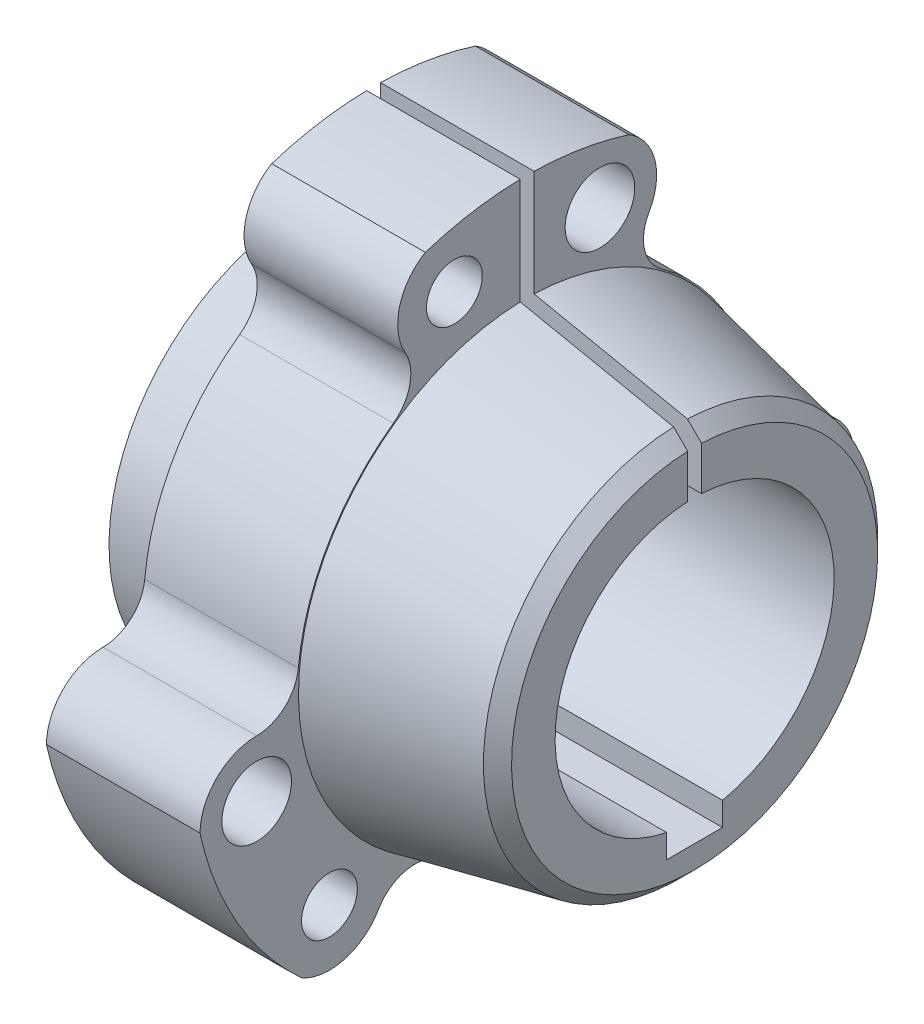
ISO-10303-21;
HEADER;
FILE_DESCRIPTION(('STEP AP214'),'2;1');
FILE_NAME('part.step','',(''),(''),'','','');
FILE_SCHEMA(('AUTOMOTIVE_DESIGN { 1 0 10303 214 1 1 1 1 }'));
ENDSEC;
DATA;
#1=APPLICATION_CONTEXT('core data for automotive mechanical design processes');
#2=APPLICATION_PROTOCOL_DEFINITION('international standard','automotive_design',2000,#1);
#3=PRODUCT_CONTEXT('',#1,'mechanical');
#4=PRODUCT('Part','Part','',(#3));
#5=PRODUCT_RELATED_PRODUCT_CATEGORY('part','',(#4));
#6=PRODUCT_DEFINITION_FORMATION('','',#4);
#7=PRODUCT_DEFINITION_CONTEXT('part definition',#1,'design');
#8=PRODUCT_DEFINITION('design','',#6,#7);
#9=PRODUCT_DEFINITION_SHAPE('','',#8);
#10=(LENGTH_UNIT() NAMED_UNIT(*) SI_UNIT(.MILLI.,.METRE.));
#11=(NAMED_UNIT(*) PLANE_ANGLE_UNIT() SI_UNIT($,.RADIAN.));
#12=(NAMED_UNIT(*) SI_UNIT($,.STERADIAN.) SOLID_ANGLE_UNIT());
#13=UNCERTAINTY_MEASURE_WITH_UNIT(LENGTH_MEASURE(1.E-05),#10,'distance_accuracy_value','');
#14=(GEOMETRIC_REPRESENTATION_CONTEXT(3) GLOBAL_UNCERTAINTY_ASSIGNED_CONTEXT((#13)) GLOBAL_UNIT_ASSIGNED_CONTEXT((#10,
#11,#12)) REPRESENTATION_CONTEXT('',''));
#15=CARTESIAN_POINT('',(0.,0.,0.));
#16=DIRECTION('',(0.,0.,1.));
#17=DIRECTION('',(1.,0.,0.));
#18=AXIS2_PLACEMENT_3D('',#15,#16,#17);
#19=CARTESIAN_POINT('',(0.,0.,0.));
#20=DIRECTION('',(-1.,0.,0.));
#21=DIRECTION('',(0.,0.,1.));
#22=AXIS2_PLACEMENT_3D('',#19,#20,#21);
#23=CYLINDRICAL_SURFACE('',#22,15.875);
#24=CARTESIAN_POINT('',(-7.9248,0.,0.));
#25=DIRECTION('',(-1.,0.,0.));
#26=DIRECTION('',(0.,0.,1.));
#27=AXIS2_PLACEMENT_3D('',#24,#25,#26);
#28=CIRCLE('',#27,15.875);
#29=CARTESIAN_POINT('',(-7.9248,15.8554604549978,-0.7874));
#30=VERTEX_POINT('',#29);
#31=CARTESIAN_POINT('',(-7.9248,-15.5542598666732,-3.175));
#32=VERTEX_POINT('',#31);
#33=EDGE_CURVE('E364',#30,#32,#28,.T.);
#34=ORIENTED_EDGE('',*,*,#33,.T.);
#35=DIRECTION('',(-1.,0.,0.));
#36=VECTOR('',#35,1.);
#37=CARTESIAN_POINT('',(0.,-15.5542598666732,-3.175));
#38=LINE('',#37,#36);
#39=CARTESIAN_POINT('',(36.5252,-15.5542598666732,-3.175));
#40=VERTEX_POINT('',#39);
#41=EDGE_CURVE('E273',#32,#40,#38,.F.);
#42=ORIENTED_EDGE('',*,*,#41,.T.);
#43=CARTESIAN_POINT('',(36.5252,0.,0.));
#44=DIRECTION('',(-1.,0.,0.));
#45=DIRECTION('',(0.,0.,1.));
#46=AXIS2_PLACEMENT_3D('',#43,#44,#45);
#47=CIRCLE('',#46,15.875);
#48=CARTESIAN_POINT('',(36.5252,15.8554604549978,-0.7874));
#49=VERTEX_POINT('',#48);
#50=EDGE_CURVE('E367',#49,#40,#47,.T.);
#51=ORIENTED_EDGE('',*,*,#50,.F.);
#52=DIRECTION('',(-1.,0.,0.));
#53=VECTOR('',#52,1.);
#54=CARTESIAN_POINT('',(0.,15.8554604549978,-0.7874));
#55=LINE('',#54,#53);
#56=EDGE_CURVE('E525',#49,#30,#55,.T.);
#57=ORIENTED_EDGE('',*,*,#56,.T.);
#58=EDGE_LOOP('',(#34,#42,#51,#57));
#59=FACE_BOUND('',#58,.T.);
#60=ADVANCED_FACE('F54',(#59),#23,.F.);
#61=CARTESIAN_POINT('',(0.,0.,0.));
#62=DIRECTION('',(-1.,0.,0.));
#63=DIRECTION('',(0.,0.,1.));
#64=AXIS2_PLACEMENT_3D('',#61,#62,#63);
#65=CYLINDRICAL_SURFACE('',#64,38.1);
#66=DIRECTION('',(-1.,0.,0.));
#67=VECTOR('',#66,1.);
#68=CARTESIAN_POINT('',(0.,38.0918626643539,0.7874));
#69=LINE('',#68,#67);
#70=CARTESIAN_POINT('',(0.,38.0918626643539,0.7874));
#71=VERTEX_POINT('',#70);
#72=CARTESIAN_POINT('',(17.4752,38.0918626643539,0.7874));
#73=VERTEX_POINT('',#72);
#74=EDGE_CURVE('E305',#71,#73,#69,.F.);
#75=ORIENTED_EDGE('',*,*,#74,.F.);
#76=CARTESIAN_POINT('',(0.,0.,0.));
#77=DIRECTION('',(-1.,0.,0.));
#78=DIRECTION('',(0.,0.,1.));
#79=AXIS2_PLACEMENT_3D('',#76,#77,#78);
#80=CIRCLE('',#79,38.1);
#81=CARTESIAN_POINT('',(0.,36.2942672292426,11.5903479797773));
#82=VERTEX_POINT('',#81);
#83=EDGE_CURVE('E559',#82,#71,#80,.T.);
#84=ORIENTED_EDGE('',*,*,#83,.F.);
#85=DIRECTION('',(-1.,0.,0.));
#86=VECTOR('',#85,1.);
#87=CARTESIAN_POINT('',(8.7376,36.2942672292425,11.5903479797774));
#88=LINE('',#87,#86);
#89=CARTESIAN_POINT('',(17.4752,36.2942672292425,11.5903479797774));
#90=VERTEX_POINT('',#89);
#91=EDGE_CURVE('E353',#90,#82,#88,.T.);
#92=ORIENTED_EDGE('',*,*,#91,.F.);
#93=CARTESIAN_POINT('',(17.4752,0.,0.));
#94=DIRECTION('',(-1.,0.,0.));
#95=DIRECTION('',(0.,0.,1.));
#96=AXIS2_PLACEMENT_3D('',#93,#94,#95);
#97=CIRCLE('',#96,38.1);
#98=EDGE_CURVE('E575',#90,#73,#97,.T.);
#99=ORIENTED_EDGE('',*,*,#98,.T.);
#100=EDGE_LOOP('',(#75,#84,#92,#99));
#101=FACE_BOUND('',#100,.T.);
#102=ADVANCED_FACE('F657',(#101),#65,.T.);
#103=CARTESIAN_POINT('',(17.4752,26.0160697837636,0.));
#104=DIRECTION('',(-1.,0.,0.));
#105=DIRECTION('',(0.,0.,1.));
#106=AXIS2_PLACEMENT_3D('',#103,#104,#105);
#107=PLANE('',#106);
#108=CARTESIAN_POINT('',(17.4752,-8.2071897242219,-30.7760695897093));
#109=DIRECTION('',(-1.,0.,0.));
#110=DIRECTION('',(0.,0.,1.));
#111=AXIS2_PLACEMENT_3D('',#108,#109,#110);
#112=CIRCLE('',#111,3.175);
#113=CARTESIAN_POINT('',(17.4752,-8.2071897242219,-27.6010695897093));
#114=VERTEX_POINT('',#113);
#115=EDGE_CURVE('E420',#114,#114,#112,.F.);
#116=ORIENTED_EDGE('',*,*,#115,.F.);
#117=EDGE_LOOP('',(#116));
#118=FACE_BOUND('',#117,.T.);
#119=CARTESIAN_POINT('',(17.4752,30.7564529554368,8.2804));
#120=DIRECTION('',(-1.,0.,0.));
#121=DIRECTION('',(0.,0.,1.));
#122=AXIS2_PLACEMENT_3D('',#119,#120,#121);
#123=CIRCLE('',#122,3.175);
#124=CARTESIAN_POINT('',(17.4752,30.7564529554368,11.4554));
#125=VERTEX_POINT('',#124);
#126=EDGE_CURVE('E408',#125,#125,#123,.F.);
#127=ORIENTED_EDGE('',*,*,#126,.F.);
#128=EDGE_LOOP('',(#127));
#129=FACE_BOUND('',#128,.T.);
#130=CARTESIAN_POINT('',(17.4752,-22.5492632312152,-22.4956695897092));
#131=DIRECTION('',(-1.,0.,0.));
#132=DIRECTION('',(0.,0.,1.));
#133=AXIS2_PLACEMENT_3D('',#130,#131,#132);
#134=CIRCLE('',#133,3.9624);
#135=CARTESIAN_POINT('',(17.4752,-22.5492632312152,-18.5332695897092));
#136=VERTEX_POINT('',#135);
#137=EDGE_CURVE('E396',#136,#136,#134,.F.);
#138=ORIENTED_EDGE('',*,*,#137,.F.);
#139=EDGE_LOOP('',(#138));
#140=FACE_BOUND('',#139,.T.);
#141=CARTESIAN_POINT('',(17.4752,30.7564529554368,-8.2804));
#142=DIRECTION('',(-1.,0.,0.));
#143=DIRECTION('',(0.,0.,1.));
#144=AXIS2_PLACEMENT_3D('',#141,#142,#143);
#145=CIRCLE('',#144,3.96240000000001);
#146=CARTESIAN_POINT('',(17.4752,30.7564529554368,-4.318));
#147=VERTEX_POINT('',#146);
#148=EDGE_CURVE('E390',#147,#147,#145,.F.);
#149=ORIENTED_EDGE('',*,*,#148,.F.);
#150=EDGE_LOOP('',(#149));
#151=FACE_BOUND('',#150,.T.);
#152=CARTESIAN_POINT('',(17.4752,-8.20718972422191,30.7760695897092));
#153=DIRECTION('',(-1.,0.,0.));
#154=DIRECTION('',(0.,0.,1.));
#155=AXIS2_PLACEMENT_3D('',#152,#153,#154);
#156=CIRCLE('',#155,3.9624);
#157=CARTESIAN_POINT('',(17.4752,-8.20718972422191,34.7384695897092));
#158=VERTEX_POINT('',#157);
#159=EDGE_CURVE('E402',#158,#158,#156,.F.);
#160=ORIENTED_EDGE('',*,*,#159,.F.);
#161=EDGE_LOOP('',(#160));
#162=FACE_BOUND('',#161,.T.);
#163=CARTESIAN_POINT('',(17.4752,-22.5492632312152,22.4956695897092));
#164=DIRECTION('',(-1.,0.,0.));
#165=DIRECTION('',(0.,0.,1.));
#166=AXIS2_PLACEMENT_3D('',#163,#164,#165);
#167=CIRCLE('',#166,3.175);
#168=CARTESIAN_POINT('',(17.4752,-22.5492632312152,25.6706695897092));
#169=VERTEX_POINT('',#168);
#170=EDGE_CURVE('E414',#169,#169,#167,.F.);
#171=ORIENTED_EDGE('',*,*,#170,.F.);
#172=EDGE_LOOP('',(#171));
#173=FACE_BOUND('',#172,.T.);
#174=CARTESIAN_POINT('',(17.4752,38.0918626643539,-0.7874));
#175=VERTEX_POINT('',#174);
#176=CARTESIAN_POINT('',(17.4752,36.2942672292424,-11.5903479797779));
#177=VERTEX_POINT('',#176);
#178=EDGE_CURVE('E378',#175,#177,#97,.T.);
#179=ORIENTED_EDGE('',*,*,#178,.F.);
#180=DIRECTION('',(0.,-1.,0.));
#181=VECTOR('',#180,1.);
#182=CARTESIAN_POINT('',(17.4752,26.0160697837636,-0.7874));
#183=LINE('',#182,#181);
#184=CARTESIAN_POINT('',(17.4752,26.0041513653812,-0.7874));
#185=VERTEX_POINT('',#184);
#186=EDGE_CURVE('E534',#175,#185,#183,.T.);
#187=ORIENTED_EDGE('',*,*,#186,.T.);
#188=CARTESIAN_POINT('',(17.4752,0.,0.));
#189=DIRECTION('',(-1.,0.,0.));
#190=DIRECTION('',(0.,0.,1.));
#191=AXIS2_PLACEMENT_3D('',#188,#189,#190);
#192=CIRCLE('',#191,26.0160697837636);
#193=CARTESIAN_POINT('',(17.4752,26.0041513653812,0.7874));
#194=VERTEX_POINT('',#193);
#195=EDGE_CURVE('E371',#185,#194,#192,.T.);
#196=ORIENTED_EDGE('',*,*,#195,.T.);
#197=DIRECTION('',(0.,-1.,0.));
#198=VECTOR('',#197,1.);
#199=CARTESIAN_POINT('',(17.4752,26.0160697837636,0.7874));
#200=LINE('',#199,#198);
#201=EDGE_CURVE('E307',#73,#194,#200,.T.);
#202=ORIENTED_EDGE('',*,*,#201,.F.);
#203=ORIENTED_EDGE('',*,*,#98,.F.);
#204=CARTESIAN_POINT('',(17.4752,30.756452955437,8.28039999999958));
#205=DIRECTION('',(-1.,0.,0.));
#206=DIRECTION('',(0.,0.,1.));
#207=AXIS2_PLACEMENT_3D('',#204,#205,#206);
#208=CIRCLE('',#207,6.4516);
#209=CARTESIAN_POINT('',(17.4752,27.537331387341,13.8714999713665));
#210=VERTEX_POINT('',#209);
#211=EDGE_CURVE('E500',#210,#90,#208,.T.);
#212=ORIENTED_EDGE('',*,*,#211,.F.);
#213=CARTESIAN_POINT('',(17.4752,25.1546744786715,18.0097944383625));
#214=DIRECTION('',(-1.,0.,0.));
#215=DIRECTION('',(0.,0.,1.));
#216=AXIS2_PLACEMENT_3D('',#213,#214,#215);
#217=CIRCLE('',#216,4.7752);
#218=CARTESIAN_POINT('',(17.4752,21.272015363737,15.2299575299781));
#219=VERTEX_POINT('',#218);
#220=EDGE_CURVE('E496',#219,#210,#217,.F.);
#221=ORIENTED_EDGE('',*,*,#220,.F.);
#222=CARTESIAN_POINT('',(17.4752,0.,0.));
#223=DIRECTION('',(-1.,0.,0.));
#224=DIRECTION('',(0.,0.,1.));
#225=AXIS2_PLACEMENT_3D('',#222,#223,#224);
#226=CIRCLE('',#225,26.162);
#227=CARTESIAN_POINT('',(17.4752,2.55352243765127,26.0370844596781));
#228=VERTEX_POINT('',#227);
#229=EDGE_CURVE('E494',#228,#219,#226,.T.);
#230=ORIENTED_EDGE('',*,*,#229,.F.);
#231=CARTESIAN_POINT('',(17.4752,3.01960226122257,30.7894843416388));
#232=DIRECTION('',(-1.,0.,0.));
#233=DIRECTION('',(0.,0.,1.));
#234=AXIS2_PLACEMENT_3D('',#231,#232,#233);
#235=CIRCLE('',#234,4.7752);
#236=CARTESIAN_POINT('',(17.4752,-1.75559432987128,30.7837785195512));
#237=VERTEX_POINT('',#236);
#238=EDGE_CURVE('E492',#237,#228,#235,.F.);
#239=ORIENTED_EDGE('',*,*,#238,.F.);
#240=CARTESIAN_POINT('',(17.4752,-8.20718972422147,30.7760695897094));
#241=DIRECTION('',(-1.,0.,0.));
#242=DIRECTION('',(0.,0.,1.));
#243=AXIS2_PLACEMENT_3D('',#240,#241,#242);
#244=CIRCLE('',#243,6.45160000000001);
#245=CARTESIAN_POINT('',(17.4752,-8.10959782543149,37.226931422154));
#246=VERTEX_POINT('',#245);
#247=EDGE_CURVE('E498',#246,#237,#244,.T.);
#248=ORIENTED_EDGE('',*,*,#247,.F.);
#249=CARTESIAN_POINT('',(17.4752,-28.1846694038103,25.6365834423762));
#250=VERTEX_POINT('',#249);
#251=EDGE_CURVE('E377',#250,#246,#97,.T.);
#252=ORIENTED_EDGE('',*,*,#251,.F.);
#253=CARTESIAN_POINT('',(17.4752,-22.5492632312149,22.4956695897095));
#254=DIRECTION('',(-1.,0.,0.));
#255=DIRECTION('',(0.,0.,1.));
#256=AXIS2_PLACEMENT_3D('',#253,#254,#255);
#257=CIRCLE('',#256,6.4516);
#258=CARTESIAN_POINT('',(17.4752,-25.7817370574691,16.9122785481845));
#259=VERTEX_POINT('',#258);
#260=EDGE_CURVE('E467',#259,#250,#257,.T.);
#261=ORIENTED_EDGE('',*,*,#260,.F.);
#262=CARTESIAN_POINT('',(17.4752,-28.1742767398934,12.7796899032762));
#263=DIRECTION('',(-1.,0.,0.));
#264=DIRECTION('',(0.,0.,1.));
#265=AXIS2_PLACEMENT_3D('',#262,#263,#264);
#266=CIRCLE('',#265,4.7752);
#267=CARTESIAN_POINT('',(17.4752,-23.8255378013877,10.8071269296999));
#268=VERTEX_POINT('',#267);
#269=EDGE_CURVE('E463',#268,#259,#266,.F.);
#270=ORIENTED_EDGE('',*,*,#269,.F.);
#271=CARTESIAN_POINT('',(17.4752,0.,0.));
#272=DIRECTION('',(-1.,0.,0.));
#273=DIRECTION('',(0.,0.,1.));
#274=AXIS2_PLACEMENT_3D('',#271,#272,#273);
#275=CIRCLE('',#274,26.162);
#276=CARTESIAN_POINT('',(17.4752,-23.8255378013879,-10.8071269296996));
#277=VERTEX_POINT('',#276);
#278=EDGE_CURVE('E461',#277,#268,#275,.T.);
#279=ORIENTED_EDGE('',*,*,#278,.F.);
#280=CARTESIAN_POINT('',(17.4752,-28.1742767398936,-12.7796899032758));
#281=DIRECTION('',(-1.,0.,0.));
#282=DIRECTION('',(0.,0.,1.));
#283=AXIS2_PLACEMENT_3D('',#280,#281,#282);
#284=CIRCLE('',#283,4.7752);
#285=CARTESIAN_POINT('',(17.4752,-25.7817370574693,-16.9122785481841));
#286=VERTEX_POINT('',#285);
#287=EDGE_CURVE('E459',#286,#277,#284,.F.);
#288=ORIENTED_EDGE('',*,*,#287,.F.);
#289=CARTESIAN_POINT('',(17.4752,-22.5492632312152,-22.4956695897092));
#290=DIRECTION('',(-1.,0.,0.));
#291=DIRECTION('',(0.,0.,1.));
#292=AXIS2_PLACEMENT_3D('',#289,#290,#291);
#293=CIRCLE('',#292,6.45160000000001);
#294=CARTESIAN_POINT('',(17.4752,-28.1846694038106,-25.6365834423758));
#295=VERTEX_POINT('',#294);
#296=EDGE_CURVE('E465',#295,#286,#293,.T.);
#297=ORIENTED_EDGE('',*,*,#296,.F.);
#298=CARTESIAN_POINT('',(17.4752,-8.10959782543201,-37.2269314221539));
#299=VERTEX_POINT('',#298);
#300=EDGE_CURVE('E374',#299,#295,#97,.T.);
#301=ORIENTED_EDGE('',*,*,#300,.F.);
#302=CARTESIAN_POINT('',(17.4752,-8.2071897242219,-30.7760695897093));
#303=DIRECTION('',(-1.,0.,0.));
#304=DIRECTION('',(0.,0.,1.));
#305=AXIS2_PLACEMENT_3D('',#302,#303,#304);
#306=CIRCLE('',#305,6.4516);
#307=CARTESIAN_POINT('',(17.4752,-1.7555943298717,-30.7837785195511));
#308=VERTEX_POINT('',#307);
#309=EDGE_CURVE('E434',#308,#299,#306,.T.);
#310=ORIENTED_EDGE('',*,*,#309,.F.);
#311=CARTESIAN_POINT('',(17.4752,3.01960226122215,-30.7894843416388));
#312=DIRECTION('',(-1.,0.,0.));
#313=DIRECTION('',(0.,0.,1.));
#314=AXIS2_PLACEMENT_3D('',#311,#312,#313);
#315=CIRCLE('',#314,4.7752);
#316=CARTESIAN_POINT('',(17.4752,2.55352243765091,-26.0370844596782));
#317=VERTEX_POINT('',#316);
#318=EDGE_CURVE('E430',#317,#308,#315,.F.);
#319=ORIENTED_EDGE('',*,*,#318,.F.);
#320=CARTESIAN_POINT('',(17.4752,0.,0.));
#321=DIRECTION('',(-1.,0.,0.));
#322=DIRECTION('',(0.,0.,1.));
#323=AXIS2_PLACEMENT_3D('',#320,#321,#322);
#324=CIRCLE('',#323,26.162);
#325=CARTESIAN_POINT('',(17.4752,21.2720153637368,-15.2299575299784));
#326=VERTEX_POINT('',#325);
#327=EDGE_CURVE('E428',#326,#317,#324,.T.);
#328=ORIENTED_EDGE('',*,*,#327,.F.);
#329=CARTESIAN_POINT('',(17.4752,25.1546744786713,-18.0097944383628));
#330=DIRECTION('',(-1.,0.,0.));
#331=DIRECTION('',(0.,0.,1.));
#332=AXIS2_PLACEMENT_3D('',#329,#330,#331);
#333=CIRCLE('',#332,4.7752);
#334=CARTESIAN_POINT('',(17.4752,27.5373313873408,-13.8714999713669));
#335=VERTEX_POINT('',#334);
#336=EDGE_CURVE('E426',#335,#326,#333,.F.);
#337=ORIENTED_EDGE('',*,*,#336,.F.);
#338=CARTESIAN_POINT('',(17.4752,30.7564529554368,-8.2804));
#339=DIRECTION('',(-1.,0.,0.));
#340=DIRECTION('',(0.,0.,1.));
#341=AXIS2_PLACEMENT_3D('',#338,#339,#340);
#342=CIRCLE('',#341,6.45160000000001);
#343=EDGE_CURVE('E432',#177,#335,#342,.T.);
#344=ORIENTED_EDGE('',*,*,#343,.F.);
#345=EDGE_LOOP('',(#179,#187,#196,#202,#203,#212,#221,#230,#239,#248,#252,#261,#270,#279,#288,
#297,#301,#310,#319,#328,#337,#344));
#346=FACE_BOUND('',#345,.T.);
#347=ADVANCED_FACE('F587',(#118,#129,#140,#151,#162,#173,#346),#107,.F.);
#348=CARTESIAN_POINT('',(0.,38.1,0.));
#349=DIRECTION('',(1.,0.,0.));
#350=DIRECTION('',(0.,0.,-1.));
#351=AXIS2_PLACEMENT_3D('',#348,#349,#350);
#352=PLANE('',#351);
#353=CARTESIAN_POINT('',(0.,-8.2071897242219,-30.7760695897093));
#354=DIRECTION('',(1.,0.,0.));
#355=DIRECTION('',(0.,0.,-1.));
#356=AXIS2_PLACEMENT_3D('',#353,#354,#355);
#357=CIRCLE('',#356,3.175);
#358=CARTESIAN_POINT('',(0.,-8.2071897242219,-33.9510695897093));
#359=VERTEX_POINT('',#358);
#360=EDGE_CURVE('E423',#359,#359,#357,.T.);
#361=ORIENTED_EDGE('',*,*,#360,.T.);
#362=EDGE_LOOP('',(#361));
#363=FACE_BOUND('',#362,.T.);
#364=CARTESIAN_POINT('',(0.,30.7564529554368,8.2804));
#365=DIRECTION('',(1.,0.,0.));
#366=DIRECTION('',(0.,0.,-1.));
#367=AXIS2_PLACEMENT_3D('',#364,#365,#366);
#368=CIRCLE('',#367,3.175);
#369=CARTESIAN_POINT('',(0.,30.7564529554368,5.1054));
#370=VERTEX_POINT('',#369);
#371=EDGE_CURVE('E411',#370,#370,#368,.T.);
#372=ORIENTED_EDGE('',*,*,#371,.T.);
#373=EDGE_LOOP('',(#372));
#374=FACE_BOUND('',#373,.T.);
#375=CARTESIAN_POINT('',(0.,-22.5492632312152,-22.4956695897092));
#376=DIRECTION('',(1.,0.,0.));
#377=DIRECTION('',(0.,0.,-1.));
#378=AXIS2_PLACEMENT_3D('',#375,#376,#377);
#379=CIRCLE('',#378,3.9624);
#380=CARTESIAN_POINT('',(0.,-22.5492632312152,-26.4580695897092));
#381=VERTEX_POINT('',#380);
#382=EDGE_CURVE('E399',#381,#381,#379,.T.);
#383=ORIENTED_EDGE('',*,*,#382,.T.);
#384=EDGE_LOOP('',(#383));
#385=FACE_BOUND('',#384,.T.);
#386=CARTESIAN_POINT('',(0.,0.,0.));
#387=DIRECTION('',(-1.,0.,0.));
#388=DIRECTION('',(0.,0.,1.));
#389=AXIS2_PLACEMENT_3D('',#386,#387,#388);
#390=CIRCLE('',#389,22.1742);
#391=CARTESIAN_POINT('',(0.,22.1602154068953,-0.7874));
#392=VERTEX_POINT('',#391);
#393=CARTESIAN_POINT('',(0.,22.1602154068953,0.7874));
#394=VERTEX_POINT('',#393);
#395=EDGE_CURVE('E384',#392,#394,#390,.T.);
#396=ORIENTED_EDGE('',*,*,#395,.F.);
#397=DIRECTION('',(0.,1.,0.));
#398=VECTOR('',#397,1.);
#399=CARTESIAN_POINT('',(0.,38.1,-0.7874));
#400=LINE('',#399,#398);
#401=CARTESIAN_POINT('',(0.,38.0918626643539,-0.7874));
#402=VERTEX_POINT('',#401);
#403=EDGE_CURVE('E539',#392,#402,#400,.T.);
#404=ORIENTED_EDGE('',*,*,#403,.T.);
#405=CARTESIAN_POINT('',(0.,36.2942672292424,-11.5903479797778));
#406=VERTEX_POINT('',#405);
#407=EDGE_CURVE('E383',#402,#406,#80,.T.);
#408=ORIENTED_EDGE('',*,*,#407,.T.);
#409=CARTESIAN_POINT('',(0.,30.7564529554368,-8.2804));
#410=DIRECTION('',(-1.,0.,0.));
#411=DIRECTION('',(0.,0.,-1.));
#412=AXIS2_PLACEMENT_3D('',#409,#410,#411);
#413=CIRCLE('',#412,6.45160000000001);
#414=CARTESIAN_POINT('',(0.,27.5373313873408,-13.8714999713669));
#415=VERTEX_POINT('',#414);
#416=EDGE_CURVE('E456',#406,#415,#413,.T.);
#417=ORIENTED_EDGE('',*,*,#416,.T.);
#418=CARTESIAN_POINT('',(0.,25.1546744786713,-18.0097944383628));
#419=DIRECTION('',(1.,0.,0.));
#420=DIRECTION('',(0.,0.,1.));
#421=AXIS2_PLACEMENT_3D('',#418,#419,#420);
#422=CIRCLE('',#421,4.7752);
#423=CARTESIAN_POINT('',(0.,21.2720153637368,-15.2299575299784));
#424=VERTEX_POINT('',#423);
#425=EDGE_CURVE('E453',#415,#424,#422,.T.);
#426=ORIENTED_EDGE('',*,*,#425,.T.);
#427=CARTESIAN_POINT('',(0.,0.,0.));
#428=DIRECTION('',(-1.,0.,0.));
#429=DIRECTION('',(0.,0.,1.));
#430=AXIS2_PLACEMENT_3D('',#427,#428,#429);
#431=CIRCLE('',#430,26.162);
#432=CARTESIAN_POINT('',(0.,2.55352243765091,-26.0370844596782));
#433=VERTEX_POINT('',#432);
#434=EDGE_CURVE('E450',#424,#433,#431,.T.);
#435=ORIENTED_EDGE('',*,*,#434,.T.);
#436=CARTESIAN_POINT('',(0.,3.01960226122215,-30.7894843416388));
#437=DIRECTION('',(1.,0.,0.));
#438=DIRECTION('',(0.,0.,-1.));
#439=AXIS2_PLACEMENT_3D('',#436,#437,#438);
#440=CIRCLE('',#439,4.7752);
#441=CARTESIAN_POINT('',(0.,-1.7555943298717,-30.7837785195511));
#442=VERTEX_POINT('',#441);
#443=EDGE_CURVE('E447',#433,#442,#440,.T.);
#444=ORIENTED_EDGE('',*,*,#443,.T.);
#445=CARTESIAN_POINT('',(0.,-8.2071897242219,-30.7760695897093));
#446=DIRECTION('',(-1.,0.,0.));
#447=DIRECTION('',(0.,0.,-1.));
#448=AXIS2_PLACEMENT_3D('',#445,#446,#447);
#449=CIRCLE('',#448,6.4516);
#450=CARTESIAN_POINT('',(0.,-8.10959782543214,-37.2269314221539));
#451=VERTEX_POINT('',#450);
#452=EDGE_CURVE('E444',#442,#451,#449,.T.);
#453=ORIENTED_EDGE('',*,*,#452,.T.);
#454=CARTESIAN_POINT('',(0.,-28.1846694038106,-25.6365834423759));
#455=VERTEX_POINT('',#454);
#456=EDGE_CURVE('E379',#451,#455,#80,.T.);
#457=ORIENTED_EDGE('',*,*,#456,.T.);
#458=CARTESIAN_POINT('',(0.,-22.5492632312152,-22.4956695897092));
#459=DIRECTION('',(-1.,0.,0.));
#460=DIRECTION('',(0.,-0.866025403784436,0.500000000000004));
#461=AXIS2_PLACEMENT_3D('',#458,#459,#460);
#462=CIRCLE('',#461,6.45160000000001);
#463=CARTESIAN_POINT('',(0.,-25.7817370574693,-16.9122785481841));
#464=VERTEX_POINT('',#463);
#465=EDGE_CURVE('E489',#455,#464,#462,.T.);
#466=ORIENTED_EDGE('',*,*,#465,.T.);
#467=CARTESIAN_POINT('',(0.,-28.1742767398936,-12.7796899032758));
#468=DIRECTION('',(1.,0.,0.));
#469=DIRECTION('',(0.,0.866025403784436,-0.500000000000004));
#470=AXIS2_PLACEMENT_3D('',#467,#468,#469);
#471=CIRCLE('',#470,4.7752);
#472=CARTESIAN_POINT('',(0.,-23.8255378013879,-10.8071269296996));
#473=VERTEX_POINT('',#472);
#474=EDGE_CURVE('E486',#464,#473,#471,.T.);
#475=ORIENTED_EDGE('',*,*,#474,.T.);
#476=CARTESIAN_POINT('',(0.,0.,0.));
#477=DIRECTION('',(-1.,0.,0.));
#478=DIRECTION('',(0.,0.866025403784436,-0.500000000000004));
#479=AXIS2_PLACEMENT_3D('',#476,#477,#478);
#480=CIRCLE('',#479,26.162);
#481=CARTESIAN_POINT('',(0.,-23.8255378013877,10.8071269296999));
#482=VERTEX_POINT('',#481);
#483=EDGE_CURVE('E483',#473,#482,#480,.T.);
#484=ORIENTED_EDGE('',*,*,#483,.T.);
#485=CARTESIAN_POINT('',(0.,-28.1742767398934,12.7796899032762));
#486=DIRECTION('',(1.,0.,0.));
#487=DIRECTION('',(0.,-0.866025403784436,0.500000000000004));
#488=AXIS2_PLACEMENT_3D('',#485,#486,#487);
#489=CIRCLE('',#488,4.7752);
#490=CARTESIAN_POINT('',(0.,-25.7817370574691,16.9122785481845));
#491=VERTEX_POINT('',#490);
#492=EDGE_CURVE('E480',#482,#491,#489,.T.);
#493=ORIENTED_EDGE('',*,*,#492,.T.);
#494=CARTESIAN_POINT('',(0.,-22.5492632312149,22.4956695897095));
#495=DIRECTION('',(-1.,0.,0.));
#496=DIRECTION('',(0.,-0.866025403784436,0.500000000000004));
#497=AXIS2_PLACEMENT_3D('',#494,#495,#496);
#498=CIRCLE('',#497,6.4516);
#499=CARTESIAN_POINT('',(0.,-28.1846694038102,25.6365834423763));
#500=VERTEX_POINT('',#499);
#501=EDGE_CURVE('E477',#491,#500,#498,.T.);
#502=ORIENTED_EDGE('',*,*,#501,.T.);
#503=CARTESIAN_POINT('',(0.,-8.10959782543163,37.226931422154));
#504=VERTEX_POINT('',#503);
#505=EDGE_CURVE('E382',#500,#504,#80,.T.);
#506=ORIENTED_EDGE('',*,*,#505,.T.);
#507=CARTESIAN_POINT('',(0.,-8.20718972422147,30.7760695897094));
#508=DIRECTION('',(-1.,0.,0.));
#509=DIRECTION('',(0.,0.866025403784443,0.499999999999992));
#510=AXIS2_PLACEMENT_3D('',#507,#508,#509);
#511=CIRCLE('',#510,6.45160000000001);
#512=CARTESIAN_POINT('',(0.,-1.75559432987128,30.7837785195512));
#513=VERTEX_POINT('',#512);
#514=EDGE_CURVE('E522',#504,#513,#511,.T.);
#515=ORIENTED_EDGE('',*,*,#514,.T.);
#516=CARTESIAN_POINT('',(0.,3.01960226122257,30.7894843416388));
#517=DIRECTION('',(1.,0.,0.));
#518=DIRECTION('',(0.,-0.866025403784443,-0.499999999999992));
#519=AXIS2_PLACEMENT_3D('',#516,#517,#518);
#520=CIRCLE('',#519,4.7752);
#521=CARTESIAN_POINT('',(0.,2.55352243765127,26.0370844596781));
#522=VERTEX_POINT('',#521);
#523=EDGE_CURVE('E519',#513,#522,#520,.T.);
#524=ORIENTED_EDGE('',*,*,#523,.T.);
#525=CARTESIAN_POINT('',(0.,0.,0.));
#526=DIRECTION('',(-1.,0.,0.));
#527=DIRECTION('',(0.,-0.866025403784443,-0.499999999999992));
#528=AXIS2_PLACEMENT_3D('',#525,#526,#527);
#529=CIRCLE('',#528,26.162);
#530=CARTESIAN_POINT('',(0.,21.272015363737,15.2299575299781));
#531=VERTEX_POINT('',#530);
#532=EDGE_CURVE('E516',#522,#531,#529,.T.);
#533=ORIENTED_EDGE('',*,*,#532,.T.);
#534=CARTESIAN_POINT('',(0.,25.1546744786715,18.0097944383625));
#535=DIRECTION('',(1.,0.,0.));
#536=DIRECTION('',(0.,0.866025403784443,0.499999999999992));
#537=AXIS2_PLACEMENT_3D('',#534,#535,#536);
#538=CIRCLE('',#537,4.7752);
#539=CARTESIAN_POINT('',(0.,27.537331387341,13.8714999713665));
#540=VERTEX_POINT('',#539);
#541=EDGE_CURVE('E513',#531,#540,#538,.T.);
#542=ORIENTED_EDGE('',*,*,#541,.T.);
#543=CARTESIAN_POINT('',(0.,30.756452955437,8.28039999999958));
#544=DIRECTION('',(-1.,0.,0.));
#545=DIRECTION('',(0.,0.866025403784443,0.499999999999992));
#546=AXIS2_PLACEMENT_3D('',#543,#544,#545);
#547=CIRCLE('',#546,6.4516);
#548=EDGE_CURVE('E510',#540,#82,#547,.T.);
#549=ORIENTED_EDGE('',*,*,#548,.T.);
#550=ORIENTED_EDGE('',*,*,#83,.T.);
#551=DIRECTION('',(0.,1.,0.));
#552=VECTOR('',#551,1.);
#553=CARTESIAN_POINT('',(0.,38.1,0.7874));
#554=LINE('',#553,#552);
#555=EDGE_CURVE('E303',#394,#71,#554,.T.);
#556=ORIENTED_EDGE('',*,*,#555,.F.);
#557=EDGE_LOOP('',(#396,#404,#408,#417,#426,#435,#444,#453,#457,#466,#475,#484,#493,#502,#506,
#515,#524,#533,#542,#549,#550,#556));
#558=FACE_BOUND('',#557,.T.);
#559=CARTESIAN_POINT('',(0.,30.7564529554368,-8.2804));
#560=DIRECTION('',(1.,0.,0.));
#561=DIRECTION('',(0.,0.,-1.));
#562=AXIS2_PLACEMENT_3D('',#559,#560,#561);
#563=CIRCLE('',#562,3.96240000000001);
#564=CARTESIAN_POINT('',(0.,30.7564529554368,-12.2428));
#565=VERTEX_POINT('',#564);
#566=EDGE_CURVE('E393',#565,#565,#563,.T.);
#567=ORIENTED_EDGE('',*,*,#566,.T.);
#568=EDGE_LOOP('',(#567));
#569=FACE_BOUND('',#568,.T.);
#570=CARTESIAN_POINT('',(0.,-8.20718972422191,30.7760695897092));
#571=DIRECTION('',(1.,0.,0.));
#572=DIRECTION('',(0.,0.,-1.));
#573=AXIS2_PLACEMENT_3D('',#570,#571,#572);
#574=CIRCLE('',#573,3.9624);
#575=CARTESIAN_POINT('',(0.,-8.20718972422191,26.8136695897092));
#576=VERTEX_POINT('',#575);
#577=EDGE_CURVE('E405',#576,#576,#574,.T.);
#578=ORIENTED_EDGE('',*,*,#577,.T.);
#579=EDGE_LOOP('',(#578));
#580=FACE_BOUND('',#579,.T.);
#581=CARTESIAN_POINT('',(0.,-22.5492632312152,22.4956695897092));
#582=DIRECTION('',(1.,0.,0.));
#583=DIRECTION('',(0.,0.,-1.));
#584=AXIS2_PLACEMENT_3D('',#581,#582,#583);
#585=CIRCLE('',#584,3.175);
#586=CARTESIAN_POINT('',(0.,-22.5492632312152,19.3206695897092));
#587=VERTEX_POINT('',#586);
#588=EDGE_CURVE('E417',#587,#587,#585,.T.);
#589=ORIENTED_EDGE('',*,*,#588,.T.);
#590=EDGE_LOOP('',(#589));
#591=FACE_BOUND('',#590,.T.);
#592=ADVANCED_FACE('F556',(#363,#374,#385,#558,#569,#580,#591),#352,.F.);
#593=DIRECTION('',(-1.,0.,0.));
#594=VECTOR('',#593,1.);
#595=CARTESIAN_POINT('',(8.7376,-8.10959782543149,37.226931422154));
#596=LINE('',#595,#594);
#597=EDGE_CURVE('E351',#504,#246,#596,.F.);
#598=ORIENTED_EDGE('',*,*,#597,.F.);
#599=ORIENTED_EDGE('',*,*,#505,.F.);
#600=DIRECTION('',(-1.,0.,0.));
#601=VECTOR('',#600,1.);
#602=CARTESIAN_POINT('',(8.7376,-28.1846694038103,25.6365834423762));
#603=LINE('',#602,#601);
#604=EDGE_CURVE('E357',#250,#500,#603,.T.);
#605=ORIENTED_EDGE('',*,*,#604,.F.);
#606=ORIENTED_EDGE('',*,*,#251,.T.);
#607=EDGE_LOOP('',(#598,#599,#605,#606));
#608=FACE_BOUND('',#607,.T.);
#609=ADVANCED_FACE('F583',(#608),#65,.T.);
#610=ORIENTED_EDGE('',*,*,#407,.F.);
#611=DIRECTION('',(-1.,0.,0.));
#612=VECTOR('',#611,1.);
#613=CARTESIAN_POINT('',(0.,38.0918626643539,-0.7874));
#614=LINE('',#613,#612);
#615=EDGE_CURVE('E537',#402,#175,#614,.F.);
#616=ORIENTED_EDGE('',*,*,#615,.T.);
#617=ORIENTED_EDGE('',*,*,#178,.T.);
#618=DIRECTION('',(-1.,0.,0.));
#619=VECTOR('',#618,1.);
#620=CARTESIAN_POINT('',(25.4,36.2942672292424,-11.5903479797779));
#621=LINE('',#620,#619);
#622=EDGE_CURVE('E359',#406,#177,#621,.F.);
#623=ORIENTED_EDGE('',*,*,#622,.F.);
#624=EDGE_LOOP('',(#610,#616,#617,#623));
#625=FACE_BOUND('',#624,.T.);
#626=ADVANCED_FACE('F572',(#625),#65,.T.);
#627=DIRECTION('',(-1.,0.,0.));
#628=VECTOR('',#627,1.);
#629=CARTESIAN_POINT('',(8.7376,-28.1846694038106,-25.6365834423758));
#630=LINE('',#629,#628);
#631=EDGE_CURVE('E355',#455,#295,#630,.F.);
#632=ORIENTED_EDGE('',*,*,#631,.F.);
#633=ORIENTED_EDGE('',*,*,#456,.F.);
#634=DIRECTION('',(-1.,0.,0.));
#635=VECTOR('',#634,1.);
#636=CARTESIAN_POINT('',(25.4,-8.10959782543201,-37.2269314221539));
#637=LINE('',#636,#635);
#638=EDGE_CURVE('E362',#299,#451,#637,.T.);
#639=ORIENTED_EDGE('',*,*,#638,.F.);
#640=ORIENTED_EDGE('',*,*,#300,.T.);
#641=EDGE_LOOP('',(#632,#633,#639,#640));
#642=FACE_BOUND('',#641,.T.);
#643=ADVANCED_FACE('F625',(#642),#65,.T.);
#644=CARTESIAN_POINT('',(-7.9248,22.1742,0.));
#645=DIRECTION('',(1.,0.,0.));
#646=DIRECTION('',(0.,0.,-1.));
#647=AXIS2_PLACEMENT_3D('',#644,#645,#646);
#648=PLANE('',#647);
#649=DIRECTION('',(0.,0.,-1.));
#650=VECTOR('',#649,1.);
#651=CARTESIAN_POINT('',(-7.9248,-18.2372,0.));
#652=LINE('',#651,#650);
#653=CARTESIAN_POINT('',(-7.9248,-18.2372,3.175));
#654=VERTEX_POINT('',#653);
#655=CARTESIAN_POINT('',(-7.9248,-18.2372,-3.175));
#656=VERTEX_POINT('',#655);
#657=EDGE_CURVE('E263',#654,#656,#652,.T.);
#658=ORIENTED_EDGE('',*,*,#657,.T.);
#659=DIRECTION('',(0.,1.,0.));
#660=VECTOR('',#659,1.);
#661=CARTESIAN_POINT('',(-7.9248,22.1742,-3.175));
#662=LINE('',#661,#660);
#663=EDGE_CURVE('E292',#656,#32,#662,.T.);
#664=ORIENTED_EDGE('',*,*,#663,.T.);
#665=ORIENTED_EDGE('',*,*,#33,.F.);
#666=DIRECTION('',(0.,1.,0.));
#667=VECTOR('',#666,1.);
#668=CARTESIAN_POINT('',(-7.9248,0.,-0.7874));
#669=LINE('',#668,#667);
#670=CARTESIAN_POINT('',(-7.9248,22.1602154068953,-0.7874));
#671=VERTEX_POINT('',#670);
#672=EDGE_CURVE('E298',#30,#671,#669,.T.);
#673=ORIENTED_EDGE('',*,*,#672,.T.);
#674=CARTESIAN_POINT('',(-7.9248,0.,0.));
#675=DIRECTION('',(-1.,0.,0.));
#676=DIRECTION('',(0.,0.,1.));
#677=AXIS2_PLACEMENT_3D('',#674,#675,#676);
#678=CIRCLE('',#677,22.1742);
#679=CARTESIAN_POINT('',(-7.9248,22.1602154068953,0.7874));
#680=VERTEX_POINT('',#679);
#681=EDGE_CURVE('E387',#671,#680,#678,.T.);
#682=ORIENTED_EDGE('',*,*,#681,.T.);
#683=DIRECTION('',(0.,1.,0.));
#684=VECTOR('',#683,1.);
#685=CARTESIAN_POINT('',(-7.9248,0.,0.7874));
#686=LINE('',#685,#684);
#687=CARTESIAN_POINT('',(-7.9248,15.8554604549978,0.7874));
#688=VERTEX_POINT('',#687);
#689=EDGE_CURVE('E301',#688,#680,#686,.T.);
#690=ORIENTED_EDGE('',*,*,#689,.F.);
#691=CARTESIAN_POINT('',(-7.9248,-15.5542598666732,3.175));
#692=VERTEX_POINT('',#691);
#693=EDGE_CURVE('E285',#692,#688,#28,.T.);
#694=ORIENTED_EDGE('',*,*,#693,.F.);
#695=DIRECTION('',(0.,-1.,0.));
#696=VECTOR('',#695,1.);
#697=CARTESIAN_POINT('',(-7.9248,22.1742,3.175));
#698=LINE('',#697,#696);
#699=EDGE_CURVE('E274',#692,#654,#698,.T.);
#700=ORIENTED_EDGE('',*,*,#699,.T.);
#701=EDGE_LOOP('',(#658,#664,#665,#673,#682,#690,#694,#700));
#702=FACE_BOUND('',#701,.T.);
#703=ADVANCED_FACE('F283',(#702),#648,.F.);
#704=CARTESIAN_POINT('',(36.5252,-15.5542598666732,3.175));
#705=VERTEX_POINT('',#704);
#706=CARTESIAN_POINT('',(36.5252,15.8554604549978,0.7874));
#707=VERTEX_POINT('',#706);
#708=EDGE_CURVE('E370',#705,#707,#47,.T.);
#709=ORIENTED_EDGE('',*,*,#708,.F.);
#710=DIRECTION('',(-1.,0.,0.));
#711=VECTOR('',#710,1.);
#712=CARTESIAN_POINT('',(0.,-15.5542598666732,3.175));
#713=LINE('',#712,#711);
#714=EDGE_CURVE('E286',#705,#692,#713,.T.);
#715=ORIENTED_EDGE('',*,*,#714,.T.);
#716=ORIENTED_EDGE('',*,*,#693,.T.);
#717=DIRECTION('',(-1.,0.,0.));
#718=VECTOR('',#717,1.);
#719=CARTESIAN_POINT('',(0.,15.8554604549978,0.7874));
#720=LINE('',#719,#718);
#721=EDGE_CURVE('E316',#707,#688,#720,.T.);
#722=ORIENTED_EDGE('',*,*,#721,.F.);
#723=EDGE_LOOP('',(#709,#715,#716,#722));
#724=FACE_BOUND('',#723,.T.);
#725=ADVANCED_FACE('F660',(#724),#23,.F.);
#726=CARTESIAN_POINT('',(36.5252,15.875,0.));
#727=DIRECTION('',(-1.,0.,0.));
#728=DIRECTION('',(0.,0.,1.));
#729=AXIS2_PLACEMENT_3D('',#726,#727,#728);
#730=PLANE('',#729);
#731=DIRECTION('',(0.,1.,0.));
#732=VECTOR('',#731,1.);
#733=CARTESIAN_POINT('',(36.5252,0.,0.7874));
#734=LINE('',#733,#732);
#735=CARTESIAN_POINT('',(36.5252,20.813110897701,0.7874));
#736=VERTEX_POINT('',#735);
#737=EDGE_CURVE('E296',#707,#736,#734,.T.);
#738=ORIENTED_EDGE('',*,*,#737,.T.);
#739=CARTESIAN_POINT('',(36.5252,0.,0.));
#740=DIRECTION('',(-1.,0.,0.));
#741=DIRECTION('',(0.,0.,1.));
#742=AXIS2_PLACEMENT_3D('',#739,#740,#741);
#743=CIRCLE('',#742,20.828);
#744=CARTESIAN_POINT('',(36.5252,20.813110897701,-0.7874));
#745=VERTEX_POINT('',#744);
#746=EDGE_CURVE('E67',#736,#745,#743,.F.);
#747=ORIENTED_EDGE('',*,*,#746,.T.);
#748=DIRECTION('',(0.,1.,0.));
#749=VECTOR('',#748,1.);
#750=CARTESIAN_POINT('',(36.5252,0.,-0.7874));
#751=LINE('',#750,#749);
#752=EDGE_CURVE('E294',#49,#745,#751,.T.);
#753=ORIENTED_EDGE('',*,*,#752,.F.);
#754=ORIENTED_EDGE('',*,*,#50,.T.);
#755=DIRECTION('',(0.,-1.,0.));
#756=VECTOR('',#755,1.);
#757=CARTESIAN_POINT('',(36.5252,15.875,-3.175));
#758=LINE('',#757,#756);
#759=CARTESIAN_POINT('',(36.5252,-18.2372,-3.175));
#760=VERTEX_POINT('',#759);
#761=EDGE_CURVE('E340',#40,#760,#758,.T.);
#762=ORIENTED_EDGE('',*,*,#761,.T.);
#763=DIRECTION('',(0.,0.,1.));
#764=VECTOR('',#763,1.);
#765=CARTESIAN_POINT('',(36.5252,-18.2372,0.));
#766=LINE('',#765,#764);
#767=CARTESIAN_POINT('',(36.5252,-18.2372,3.175));
#768=VERTEX_POINT('',#767);
#769=EDGE_CURVE('E343',#760,#768,#766,.T.);
#770=ORIENTED_EDGE('',*,*,#769,.T.);
#771=DIRECTION('',(0.,1.,0.));
#772=VECTOR('',#771,1.);
#773=CARTESIAN_POINT('',(36.5252,15.875,3.175));
#774=LINE('',#773,#772);
#775=EDGE_CURVE('E280',#768,#705,#774,.T.);
#776=ORIENTED_EDGE('',*,*,#775,.T.);
#777=ORIENTED_EDGE('',*,*,#708,.T.);
#778=EDGE_LOOP('',(#738,#747,#753,#754,#762,#770,#776,#777));
#779=FACE_BOUND('',#778,.T.);
#780=ADVANCED_FACE('F666',(#779),#730,.F.);
#781=CARTESIAN_POINT('',(36.5252,0.,0.));
#782=DIRECTION('',(-1.,0.,0.));
#783=DIRECTION('',(0.,0.,1.));
#784=AXIS2_PLACEMENT_3D('',#781,#782,#783);
#785=CONICAL_SURFACE('',#784,22.098,0.202844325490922);
#786=CARTESIAN_POINT('',(-17.9883497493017,33.3006550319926,-0.7874));
#787=CARTESIAN_POINT('',(-11.2096124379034,31.9060586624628,-0.7874));
#788=CARTESIAN_POINT('',(-4.43088321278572,30.5114229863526,-0.7874));
#789=CARTESIAN_POINT('',(9.12654570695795,27.7220081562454,-0.7874));
#790=CARTESIAN_POINT('',(15.905245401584,26.3272290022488,-0.7874));
#791=CARTESIAN_POINT('',(29.4626019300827,23.5374623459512,-0.7874));
#792=CARTESIAN_POINT('',(36.2412587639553,22.1424748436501,-0.7874));
#793=CARTESIAN_POINT('',(49.7984891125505,19.3520949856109,-0.7874));
#794=CARTESIAN_POINT('',(56.5770626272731,17.9567026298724,-0.7874));
#795=CARTESIAN_POINT('',(63.355574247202,16.5610095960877,-0.7874));
#796=B_SPLINE_CURVE_WITH_KNOTS('',3,(#786,#787,#788,#789,#790,#791,#792,#793,#794,#795),
.UNSPECIFIED.,.F.,.F.,(4,2,2,2,4),(0.,20.7621195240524,41.5242390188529,62.2863585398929,
83.0484780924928),.UNSPECIFIED.);
#797=CARTESIAN_POINT('',(34.9263623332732,22.4130107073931,-0.7874));
#798=VERTEX_POINT('',#797);
#799=EDGE_CURVE('E528',#185,#798,#796,.T.);
#800=ORIENTED_EDGE('',*,*,#799,.T.);
#801=CARTESIAN_POINT('',(34.9263623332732,0.,0.));
#802=DIRECTION('',(1.,0.,0.));
#803=DIRECTION('',(0.,0.,-1.));
#804=AXIS2_PLACEMENT_3D('',#801,#802,#803);
#805=CIRCLE('',#804,22.4268376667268);
#806=CARTESIAN_POINT('',(34.9263623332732,22.4130107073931,0.7874));
#807=VERTEX_POINT('',#806);
#808=EDGE_CURVE('E337',#798,#807,#805,.F.);
#809=ORIENTED_EDGE('',*,*,#808,.T.);
#810=CARTESIAN_POINT('',(-17.9883497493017,33.3006550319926,0.7874));
#811=CARTESIAN_POINT('',(-11.2096124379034,31.9060586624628,0.7874));
#812=CARTESIAN_POINT('',(-4.43088321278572,30.5114229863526,0.7874));
#813=CARTESIAN_POINT('',(9.12654570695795,27.7220081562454,0.7874));
#814=CARTESIAN_POINT('',(15.905245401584,26.3272290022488,0.7874));
#815=CARTESIAN_POINT('',(29.4626019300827,23.5374623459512,0.7874));
#816=CARTESIAN_POINT('',(36.2412587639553,22.1424748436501,0.7874));
#817=CARTESIAN_POINT('',(49.7984891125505,19.3520949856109,0.7874));
#818=CARTESIAN_POINT('',(56.5770626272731,17.9567026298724,0.7874));
#819=CARTESIAN_POINT('',(63.355574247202,16.5610095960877,0.7874));
#820=B_SPLINE_CURVE_WITH_KNOTS('',3,(#810,#811,#812,#813,#814,#815,#816,#817,#818,#819),
.UNSPECIFIED.,.F.,.F.,(4,2,2,2,4),(0.,20.7621195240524,41.5242390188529,62.2863585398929,
83.0484780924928),.UNSPECIFIED.);
#821=EDGE_CURVE('E309',#194,#807,#820,.T.);
#822=ORIENTED_EDGE('',*,*,#821,.F.);
#823=ORIENTED_EDGE('',*,*,#195,.F.);
#824=EDGE_LOOP('',(#800,#809,#822,#823));
#825=FACE_BOUND('',#824,.T.);
#826=ADVANCED_FACE('F318',(#825),#785,.T.);
#827=CARTESIAN_POINT('',(0.,0.,0.));
#828=DIRECTION('',(-1.,0.,0.));
#829=DIRECTION('',(0.,0.,1.));
#830=AXIS2_PLACEMENT_3D('',#827,#828,#829);
#831=CYLINDRICAL_SURFACE('',#830,22.1742);
#832=ORIENTED_EDGE('',*,*,#681,.F.);
#833=DIRECTION('',(-1.,0.,0.));
#834=VECTOR('',#833,1.);
#835=CARTESIAN_POINT('',(0.,22.1602154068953,-0.7874));
#836=LINE('',#835,#834);
#837=EDGE_CURVE('E346',#671,#392,#836,.F.);
#838=ORIENTED_EDGE('',*,*,#837,.T.);
#839=ORIENTED_EDGE('',*,*,#395,.T.);
#840=DIRECTION('',(-1.,0.,0.));
#841=VECTOR('',#840,1.);
#842=CARTESIAN_POINT('',(0.,22.1602154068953,0.7874));
#843=LINE('',#842,#841);
#844=EDGE_CURVE('E349',#680,#394,#843,.F.);
#845=ORIENTED_EDGE('',*,*,#844,.F.);
#846=EDGE_LOOP('',(#832,#838,#839,#845));
#847=FACE_BOUND('',#846,.T.);
#848=ADVANCED_FACE('F552',(#847),#831,.T.);
#849=CARTESIAN_POINT('',(50.8,30.7564529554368,-8.2804));
#850=DIRECTION('',(-1.,0.,0.));
#851=DIRECTION('',(0.,0.,1.));
#852=AXIS2_PLACEMENT_3D('',#849,#850,#851);
#853=CYLINDRICAL_SURFACE('',#852,3.96240000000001);
#854=ORIENTED_EDGE('',*,*,#566,.F.);
#855=EDGE_LOOP('',(#854));
#856=FACE_BOUND('',#855,.T.);
#857=ORIENTED_EDGE('',*,*,#148,.T.);
#858=EDGE_LOOP('',(#857));
#859=FACE_BOUND('',#858,.T.);
#860=ADVANCED_FACE('F736',(#856,#859),#853,.F.);
#861=CARTESIAN_POINT('',(50.8,-22.5492632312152,-22.4956695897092));
#862=DIRECTION('',(-1.,0.,0.));
#863=DIRECTION('',(0.,0.,1.));
#864=AXIS2_PLACEMENT_3D('',#861,#862,#863);
#865=CYLINDRICAL_SURFACE('',#864,3.9624);
#866=ORIENTED_EDGE('',*,*,#382,.F.);
#867=EDGE_LOOP('',(#866));
#868=FACE_BOUND('',#867,.T.);
#869=ORIENTED_EDGE('',*,*,#137,.T.);
#870=EDGE_LOOP('',(#869));
#871=FACE_BOUND('',#870,.T.);
#872=ADVANCED_FACE('F732',(#868,#871),#865,.F.);
#873=CARTESIAN_POINT('',(50.8,-8.20718972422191,30.7760695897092));
#874=DIRECTION('',(-1.,0.,0.));
#875=DIRECTION('',(0.,0.,1.));
#876=AXIS2_PLACEMENT_3D('',#873,#874,#875);
#877=CYLINDRICAL_SURFACE('',#876,3.9624);
#878=ORIENTED_EDGE('',*,*,#577,.F.);
#879=EDGE_LOOP('',(#878));
#880=FACE_BOUND('',#879,.T.);
#881=ORIENTED_EDGE('',*,*,#159,.T.);
#882=EDGE_LOOP('',(#881));
#883=FACE_BOUND('',#882,.T.);
#884=ADVANCED_FACE('F728',(#880,#883),#877,.F.);
#885=CARTESIAN_POINT('',(50.8,30.7564529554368,8.2804));
#886=DIRECTION('',(-1.,0.,0.));
#887=DIRECTION('',(0.,0.,1.));
#888=AXIS2_PLACEMENT_3D('',#885,#886,#887);
#889=CYLINDRICAL_SURFACE('',#888,3.175);
#890=ORIENTED_EDGE('',*,*,#371,.F.);
#891=EDGE_LOOP('',(#890));
#892=FACE_BOUND('',#891,.T.);
#893=ORIENTED_EDGE('',*,*,#126,.T.);
#894=EDGE_LOOP('',(#893));
#895=FACE_BOUND('',#894,.T.);
#896=ADVANCED_FACE('F724',(#892,#895),#889,.F.);
#897=CARTESIAN_POINT('',(50.8,-22.5492632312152,22.4956695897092));
#898=DIRECTION('',(-1.,0.,0.));
#899=DIRECTION('',(0.,0.,1.));
#900=AXIS2_PLACEMENT_3D('',#897,#898,#899);
#901=CYLINDRICAL_SURFACE('',#900,3.175);
#902=ORIENTED_EDGE('',*,*,#588,.F.);
#903=EDGE_LOOP('',(#902));
#904=FACE_BOUND('',#903,.T.);
#905=ORIENTED_EDGE('',*,*,#170,.T.);
#906=EDGE_LOOP('',(#905));
#907=FACE_BOUND('',#906,.T.);
#908=ADVANCED_FACE('F652',(#904,#907),#901,.F.);
#909=CARTESIAN_POINT('',(50.8,-8.2071897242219,-30.7760695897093));
#910=DIRECTION('',(-1.,0.,0.));
#911=DIRECTION('',(0.,0.,1.));
#912=AXIS2_PLACEMENT_3D('',#909,#910,#911);
#913=CYLINDRICAL_SURFACE('',#912,3.175);
#914=ORIENTED_EDGE('',*,*,#360,.F.);
#915=EDGE_LOOP('',(#914));
#916=FACE_BOUND('',#915,.T.);
#917=ORIENTED_EDGE('',*,*,#115,.T.);
#918=EDGE_LOOP('',(#917));
#919=FACE_BOUND('',#918,.T.);
#920=ADVANCED_FACE('F645',(#916,#919),#913,.F.);
#921=CARTESIAN_POINT('',(50.8,25.1546744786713,-18.0097944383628));
#922=DIRECTION('',(-1.,0.,0.));
#923=DIRECTION('',(0.,0.,1.));
#924=AXIS2_PLACEMENT_3D('',#921,#922,#923);
#925=CYLINDRICAL_SURFACE('',#924,4.7752);
#926=ORIENTED_EDGE('',*,*,#336,.T.);
#927=DIRECTION('',(-1.,0.,0.));
#928=VECTOR('',#927,1.);
#929=CARTESIAN_POINT('',(50.8,21.2720153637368,-15.2299575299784));
#930=LINE('',#929,#928);
#931=EDGE_CURVE('E438',#326,#424,#930,.T.);
#932=ORIENTED_EDGE('',*,*,#931,.T.);
#933=ORIENTED_EDGE('',*,*,#425,.F.);
#934=DIRECTION('',(-1.,0.,0.));
#935=VECTOR('',#934,1.);
#936=CARTESIAN_POINT('',(50.8,27.5373313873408,-13.8714999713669));
#937=LINE('',#936,#935);
#938=EDGE_CURVE('E436',#335,#415,#937,.T.);
#939=ORIENTED_EDGE('',*,*,#938,.F.);
#940=EDGE_LOOP('',(#926,#932,#933,#939));
#941=FACE_BOUND('',#940,.T.);
#942=ADVANCED_FACE('F643',(#941),#925,.F.);
#943=CARTESIAN_POINT('',(50.8,0.,0.));
#944=DIRECTION('',(-1.,0.,0.));
#945=DIRECTION('',(0.,0.,1.));
#946=AXIS2_PLACEMENT_3D('',#943,#944,#945);
#947=CYLINDRICAL_SURFACE('',#946,26.162);
#948=ORIENTED_EDGE('',*,*,#327,.T.);
#949=DIRECTION('',(-1.,0.,0.));
#950=VECTOR('',#949,1.);
#951=CARTESIAN_POINT('',(50.8,2.55352243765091,-26.0370844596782));
#952=LINE('',#951,#950);
#953=EDGE_CURVE('E440',#317,#433,#952,.T.);
#954=ORIENTED_EDGE('',*,*,#953,.T.);
#955=ORIENTED_EDGE('',*,*,#434,.F.);
#956=ORIENTED_EDGE('',*,*,#931,.F.);
#957=EDGE_LOOP('',(#948,#954,#955,#956));
#958=FACE_BOUND('',#957,.T.);
#959=ADVANCED_FACE('F641',(#958),#947,.T.);
#960=CARTESIAN_POINT('',(50.8,3.01960226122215,-30.7894843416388));
#961=DIRECTION('',(-1.,0.,0.));
#962=DIRECTION('',(0.,0.,1.));
#963=AXIS2_PLACEMENT_3D('',#960,#961,#962);
#964=CYLINDRICAL_SURFACE('',#963,4.7752);
#965=ORIENTED_EDGE('',*,*,#318,.T.);
#966=DIRECTION('',(-1.,0.,0.));
#967=VECTOR('',#966,1.);
#968=CARTESIAN_POINT('',(50.8,-1.7555943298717,-30.7837785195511));
#969=LINE('',#968,#967);
#970=EDGE_CURVE('E442',#308,#442,#969,.T.);
#971=ORIENTED_EDGE('',*,*,#970,.T.);
#972=ORIENTED_EDGE('',*,*,#443,.F.);
#973=ORIENTED_EDGE('',*,*,#953,.F.);
#974=EDGE_LOOP('',(#965,#971,#972,#973));
#975=FACE_BOUND('',#974,.T.);
#976=ADVANCED_FACE('F635',(#975),#964,.F.);
#977=CARTESIAN_POINT('',(50.8,30.7564529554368,-8.2804));
#978=DIRECTION('',(-1.,0.,0.));
#979=DIRECTION('',(0.,0.,1.));
#980=AXIS2_PLACEMENT_3D('',#977,#978,#979);
#981=CYLINDRICAL_SURFACE('',#980,6.45160000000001);
#982=ORIENTED_EDGE('',*,*,#343,.T.);
#983=ORIENTED_EDGE('',*,*,#938,.T.);
#984=ORIENTED_EDGE('',*,*,#416,.F.);
#985=ORIENTED_EDGE('',*,*,#622,.T.);
#986=EDGE_LOOP('',(#982,#983,#984,#985));
#987=FACE_BOUND('',#986,.T.);
#988=ADVANCED_FACE('F568',(#987),#981,.T.);
#989=CARTESIAN_POINT('',(50.8,-8.2071897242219,-30.7760695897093));
#990=DIRECTION('',(-1.,0.,0.));
#991=DIRECTION('',(0.,0.,1.));
#992=AXIS2_PLACEMENT_3D('',#989,#990,#991);
#993=CYLINDRICAL_SURFACE('',#992,6.4516);
#994=ORIENTED_EDGE('',*,*,#309,.T.);
#995=ORIENTED_EDGE('',*,*,#638,.T.);
#996=ORIENTED_EDGE('',*,*,#452,.F.);
#997=ORIENTED_EDGE('',*,*,#970,.F.);
#998=EDGE_LOOP('',(#994,#995,#996,#997));
#999=FACE_BOUND('',#998,.T.);
#1000=ADVANCED_FACE('F629',(#999),#993,.T.);
#1001=CARTESIAN_POINT('',(50.8,-28.1742767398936,-12.7796899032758));
#1002=DIRECTION('',(-1.,0.,0.));
#1003=DIRECTION('',(0.,0.,1.));
#1004=AXIS2_PLACEMENT_3D('',#1001,#1002,#1003);
#1005=CYLINDRICAL_SURFACE('',#1004,4.7752);
#1006=ORIENTED_EDGE('',*,*,#287,.T.);
#1007=DIRECTION('',(-1.,0.,0.));
#1008=VECTOR('',#1007,1.);
#1009=CARTESIAN_POINT('',(50.8,-23.8255378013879,-10.8071269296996));
#1010=LINE('',#1009,#1008);
#1011=EDGE_CURVE('E471',#277,#473,#1010,.T.);
#1012=ORIENTED_EDGE('',*,*,#1011,.T.);
#1013=ORIENTED_EDGE('',*,*,#474,.F.);
#1014=DIRECTION('',(-1.,0.,0.));
#1015=VECTOR('',#1014,1.);
#1016=CARTESIAN_POINT('',(50.8,-25.7817370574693,-16.9122785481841));
#1017=LINE('',#1016,#1015);
#1018=EDGE_CURVE('E469',#286,#464,#1017,.T.);
#1019=ORIENTED_EDGE('',*,*,#1018,.F.);
#1020=EDGE_LOOP('',(#1006,#1012,#1013,#1019));
#1021=FACE_BOUND('',#1020,.T.);
#1022=ADVANCED_FACE('F616',(#1021),#1005,.F.);
#1023=CARTESIAN_POINT('',(50.8,0.,0.));
#1024=DIRECTION('',(-1.,0.,0.));
#1025=DIRECTION('',(0.,0.,1.));
#1026=AXIS2_PLACEMENT_3D('',#1023,#1024,#1025);
#1027=CYLINDRICAL_SURFACE('',#1026,26.162);
#1028=ORIENTED_EDGE('',*,*,#278,.T.);
#1029=DIRECTION('',(-1.,0.,0.));
#1030=VECTOR('',#1029,1.);
#1031=CARTESIAN_POINT('',(50.8,-23.8255378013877,10.8071269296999));
#1032=LINE('',#1031,#1030);
#1033=EDGE_CURVE('E473',#268,#482,#1032,.T.);
#1034=ORIENTED_EDGE('',*,*,#1033,.T.);
#1035=ORIENTED_EDGE('',*,*,#483,.F.);
#1036=ORIENTED_EDGE('',*,*,#1011,.F.);
#1037=EDGE_LOOP('',(#1028,#1034,#1035,#1036));
#1038=FACE_BOUND('',#1037,.T.);
#1039=ADVANCED_FACE('F612',(#1038),#1027,.T.);
#1040=CARTESIAN_POINT('',(50.8,-28.1742767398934,12.7796899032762));
#1041=DIRECTION('',(-1.,0.,0.));
#1042=DIRECTION('',(0.,0.,1.));
#1043=AXIS2_PLACEMENT_3D('',#1040,#1041,#1042);
#1044=CYLINDRICAL_SURFACE('',#1043,4.7752);
#1045=ORIENTED_EDGE('',*,*,#269,.T.);
#1046=DIRECTION('',(-1.,0.,0.));
#1047=VECTOR('',#1046,1.);
#1048=CARTESIAN_POINT('',(50.8,-25.7817370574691,16.9122785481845));
#1049=LINE('',#1048,#1047);
#1050=EDGE_CURVE('E475',#259,#491,#1049,.T.);
#1051=ORIENTED_EDGE('',*,*,#1050,.T.);
#1052=ORIENTED_EDGE('',*,*,#492,.F.);
#1053=ORIENTED_EDGE('',*,*,#1033,.F.);
#1054=EDGE_LOOP('',(#1045,#1051,#1052,#1053));
#1055=FACE_BOUND('',#1054,.T.);
#1056=ADVANCED_FACE('F605',(#1055),#1044,.F.);
#1057=CARTESIAN_POINT('',(50.8,-22.5492632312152,-22.4956695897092));
#1058=DIRECTION('',(-1.,0.,0.));
#1059=DIRECTION('',(0.,0.,1.));
#1060=AXIS2_PLACEMENT_3D('',#1057,#1058,#1059);
#1061=CYLINDRICAL_SURFACE('',#1060,6.45160000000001);
#1062=ORIENTED_EDGE('',*,*,#296,.T.);
#1063=ORIENTED_EDGE('',*,*,#1018,.T.);
#1064=ORIENTED_EDGE('',*,*,#465,.F.);
#1065=ORIENTED_EDGE('',*,*,#631,.T.);
#1066=EDGE_LOOP('',(#1062,#1063,#1064,#1065));
#1067=FACE_BOUND('',#1066,.T.);
#1068=ADVANCED_FACE('F619',(#1067),#1061,.T.);
#1069=CARTESIAN_POINT('',(50.8,-22.5492632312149,22.4956695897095));
#1070=DIRECTION('',(-1.,0.,0.));
#1071=DIRECTION('',(0.,0.,1.));
#1072=AXIS2_PLACEMENT_3D('',#1069,#1070,#1071);
#1073=CYLINDRICAL_SURFACE('',#1072,6.4516);
#1074=ORIENTED_EDGE('',*,*,#260,.T.);
#1075=ORIENTED_EDGE('',*,*,#604,.T.);
#1076=ORIENTED_EDGE('',*,*,#501,.F.);
#1077=ORIENTED_EDGE('',*,*,#1050,.F.);
#1078=EDGE_LOOP('',(#1074,#1075,#1076,#1077));
#1079=FACE_BOUND('',#1078,.T.);
#1080=ADVANCED_FACE('F603',(#1079),#1073,.T.);
#1081=CARTESIAN_POINT('',(50.8,3.01960226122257,30.7894843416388));
#1082=DIRECTION('',(-1.,0.,0.));
#1083=DIRECTION('',(0.,0.,1.));
#1084=AXIS2_PLACEMENT_3D('',#1081,#1082,#1083);
#1085=CYLINDRICAL_SURFACE('',#1084,4.7752);
#1086=ORIENTED_EDGE('',*,*,#238,.T.);
#1087=DIRECTION('',(-1.,0.,0.));
#1088=VECTOR('',#1087,1.);
#1089=CARTESIAN_POINT('',(50.8,2.55352243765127,26.0370844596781));
#1090=LINE('',#1089,#1088);
#1091=EDGE_CURVE('E504',#228,#522,#1090,.T.);
#1092=ORIENTED_EDGE('',*,*,#1091,.T.);
#1093=ORIENTED_EDGE('',*,*,#523,.F.);
#1094=DIRECTION('',(-1.,0.,0.));
#1095=VECTOR('',#1094,1.);
#1096=CARTESIAN_POINT('',(50.8,-1.75559432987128,30.7837785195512));
#1097=LINE('',#1096,#1095);
#1098=EDGE_CURVE('E502',#237,#513,#1097,.T.);
#1099=ORIENTED_EDGE('',*,*,#1098,.F.);
#1100=EDGE_LOOP('',(#1086,#1092,#1093,#1099));
#1101=FACE_BOUND('',#1100,.T.);
#1102=ADVANCED_FACE('F596',(#1101),#1085,.F.);
#1103=CARTESIAN_POINT('',(50.8,0.,0.));
#1104=DIRECTION('',(-1.,0.,0.));
#1105=DIRECTION('',(0.,0.,1.));
#1106=AXIS2_PLACEMENT_3D('',#1103,#1104,#1105);
#1107=CYLINDRICAL_SURFACE('',#1106,26.162);
#1108=ORIENTED_EDGE('',*,*,#229,.T.);
#1109=DIRECTION('',(-1.,0.,0.));
#1110=VECTOR('',#1109,1.);
#1111=CARTESIAN_POINT('',(50.8,21.272015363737,15.2299575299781));
#1112=LINE('',#1111,#1110);
#1113=EDGE_CURVE('E506',#219,#531,#1112,.T.);
#1114=ORIENTED_EDGE('',*,*,#1113,.T.);
#1115=ORIENTED_EDGE('',*,*,#532,.F.);
#1116=ORIENTED_EDGE('',*,*,#1091,.F.);
#1117=EDGE_LOOP('',(#1108,#1114,#1115,#1116));
#1118=FACE_BOUND('',#1117,.T.);
#1119=ADVANCED_FACE('F691',(#1118),#1107,.T.);
#1120=CARTESIAN_POINT('',(50.8,25.1546744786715,18.0097944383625));
#1121=DIRECTION('',(-1.,0.,0.));
#1122=DIRECTION('',(0.,0.,1.));
#1123=AXIS2_PLACEMENT_3D('',#1120,#1121,#1122);
#1124=CYLINDRICAL_SURFACE('',#1123,4.7752);
#1125=ORIENTED_EDGE('',*,*,#220,.T.);
#1126=DIRECTION('',(-1.,0.,0.));
#1127=VECTOR('',#1126,1.);
#1128=CARTESIAN_POINT('',(50.8,27.537331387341,13.8714999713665));
#1129=LINE('',#1128,#1127);
#1130=EDGE_CURVE('E508',#210,#540,#1129,.T.);
#1131=ORIENTED_EDGE('',*,*,#1130,.T.);
#1132=ORIENTED_EDGE('',*,*,#541,.F.);
#1133=ORIENTED_EDGE('',*,*,#1113,.F.);
#1134=EDGE_LOOP('',(#1125,#1131,#1132,#1133));
#1135=FACE_BOUND('',#1134,.T.);
#1136=ADVANCED_FACE('F688',(#1135),#1124,.F.);
#1137=CARTESIAN_POINT('',(50.8,-8.20718972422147,30.7760695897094));
#1138=DIRECTION('',(-1.,0.,0.));
#1139=DIRECTION('',(0.,0.,1.));
#1140=AXIS2_PLACEMENT_3D('',#1137,#1138,#1139);
#1141=CYLINDRICAL_SURFACE('',#1140,6.45160000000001);
#1142=ORIENTED_EDGE('',*,*,#247,.T.);
#1143=ORIENTED_EDGE('',*,*,#1098,.T.);
#1144=ORIENTED_EDGE('',*,*,#514,.F.);
#1145=ORIENTED_EDGE('',*,*,#597,.T.);
#1146=EDGE_LOOP('',(#1142,#1143,#1144,#1145));
#1147=FACE_BOUND('',#1146,.T.);
#1148=ADVANCED_FACE('F593',(#1147),#1141,.T.);
#1149=CARTESIAN_POINT('',(50.8,30.756452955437,8.28039999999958));
#1150=DIRECTION('',(-1.,0.,0.));
#1151=DIRECTION('',(0.,0.,1.));
#1152=AXIS2_PLACEMENT_3D('',#1149,#1150,#1151);
#1153=CYLINDRICAL_SURFACE('',#1152,6.4516);
#1154=ORIENTED_EDGE('',*,*,#211,.T.);
#1155=ORIENTED_EDGE('',*,*,#91,.T.);
#1156=ORIENTED_EDGE('',*,*,#548,.F.);
#1157=ORIENTED_EDGE('',*,*,#1130,.F.);
#1158=EDGE_LOOP('',(#1154,#1155,#1156,#1157));
#1159=FACE_BOUND('',#1158,.T.);
#1160=ADVANCED_FACE('F327',(#1159),#1153,.T.);
#1161=CARTESIAN_POINT('',(-7.9248,0.,0.7874));
#1162=DIRECTION('',(0.,0.,-1.));
#1163=DIRECTION('',(-1.,0.,0.));
#1164=AXIS2_PLACEMENT_3D('',#1161,#1162,#1163);
#1165=PLANE('',#1164);
#1166=ORIENTED_EDGE('',*,*,#821,.T.);
#1167=CARTESIAN_POINT('',(34.9263623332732,22.4130107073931,0.787400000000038));
#1168=CARTESIAN_POINT('',(35.1928418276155,22.1463672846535,0.787400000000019));
#1169=CARTESIAN_POINT('',(35.4593180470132,21.8797205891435,0.787400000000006));
#1170=CARTESIAN_POINT('',(35.9922639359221,21.3464206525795,0.787399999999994));
#1171=CARTESIAN_POINT('',(36.2587336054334,21.0797674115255,0.787399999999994));
#1172=CARTESIAN_POINT('',(36.5252,20.813110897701,0.7874));
#1173=B_SPLINE_CURVE_WITH_KNOTS('',3,(#1167,#1168,#1169,#1170,#1171,#1172),.UNSPECIFIED.,.F.,
.F.,(4,2,4),(0.,1.1309245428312,2.26184908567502),.UNSPECIFIED.);
#1174=EDGE_CURVE('E81',#807,#736,#1173,.T.);
#1175=ORIENTED_EDGE('',*,*,#1174,.T.);
#1176=ORIENTED_EDGE('',*,*,#737,.F.);
#1177=ORIENTED_EDGE('',*,*,#721,.T.);
#1178=ORIENTED_EDGE('',*,*,#689,.T.);
#1179=ORIENTED_EDGE('',*,*,#844,.T.);
#1180=ORIENTED_EDGE('',*,*,#555,.T.);
#1181=ORIENTED_EDGE('',*,*,#74,.T.);
#1182=ORIENTED_EDGE('',*,*,#201,.T.);
#1183=EDGE_LOOP('',(#1166,#1175,#1176,#1177,#1178,#1179,#1180,#1181,#1182));
#1184=FACE_BOUND('',#1183,.T.);
#1185=ADVANCED_FACE('F322',(#1184),#1165,.T.);
#1186=CARTESIAN_POINT('',(-7.9248,0.,-0.7874));
#1187=DIRECTION('',(0.,0.,-1.));
#1188=DIRECTION('',(-1.,0.,0.));
#1189=AXIS2_PLACEMENT_3D('',#1186,#1187,#1188);
#1190=PLANE('',#1189);
#1191=ORIENTED_EDGE('',*,*,#752,.T.);
#1192=CARTESIAN_POINT('',(36.5252,20.813110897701,-0.7874));
#1193=CARTESIAN_POINT('',(36.2587336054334,21.0797674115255,-0.7874));
#1194=CARTESIAN_POINT('',(35.9922639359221,21.3464206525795,-0.7874));
#1195=CARTESIAN_POINT('',(35.4593180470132,21.8797205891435,-0.7874));
#1196=CARTESIAN_POINT('',(35.1928418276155,22.1463672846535,-0.7874));
#1197=CARTESIAN_POINT('',(34.9263623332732,22.4130107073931,-0.7874));
#1198=B_SPLINE_CURVE_WITH_KNOTS('',3,(#1192,#1193,#1194,#1195,#1196,#1197),.UNSPECIFIED.,.F.,
.F.,(4,2,4),(0.,1.13092454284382,2.26184908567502),.UNSPECIFIED.);
#1199=EDGE_CURVE('E12',#745,#798,#1198,.T.);
#1200=ORIENTED_EDGE('',*,*,#1199,.T.);
#1201=ORIENTED_EDGE('',*,*,#799,.F.);
#1202=ORIENTED_EDGE('',*,*,#186,.F.);
#1203=ORIENTED_EDGE('',*,*,#615,.F.);
#1204=ORIENTED_EDGE('',*,*,#403,.F.);
#1205=ORIENTED_EDGE('',*,*,#837,.F.);
#1206=ORIENTED_EDGE('',*,*,#672,.F.);
#1207=ORIENTED_EDGE('',*,*,#56,.F.);
#1208=EDGE_LOOP('',(#1191,#1200,#1201,#1202,#1203,#1204,#1205,#1206,#1207));
#1209=FACE_BOUND('',#1208,.T.);
#1210=ADVANCED_FACE('F326',(#1209),#1190,.F.);
#1211=CARTESIAN_POINT('',(-38.1,-18.2372,-3.175));
#1212=DIRECTION('',(0.,0.,-1.));
#1213=DIRECTION('',(0.,1.,0.));
#1214=AXIS2_PLACEMENT_3D('',#1211,#1212,#1213);
#1215=PLANE('',#1214);
#1216=DIRECTION('',(1.,0.,0.));
#1217=VECTOR('',#1216,1.);
#1218=CARTESIAN_POINT('',(-38.1,-18.2372,-3.175));
#1219=LINE('',#1218,#1217);
#1220=EDGE_CURVE('E269',#656,#760,#1219,.T.);
#1221=ORIENTED_EDGE('',*,*,#1220,.T.);
#1222=ORIENTED_EDGE('',*,*,#761,.F.);
#1223=ORIENTED_EDGE('',*,*,#41,.F.);
#1224=ORIENTED_EDGE('',*,*,#663,.F.);
#1225=EDGE_LOOP('',(#1221,#1222,#1223,#1224));
#1226=FACE_BOUND('',#1225,.T.);
#1227=ADVANCED_FACE('F672',(#1226),#1215,.F.);
#1228=CARTESIAN_POINT('',(-38.1,-18.2372,3.175));
#1229=DIRECTION('',(0.,-1.,0.));
#1230=DIRECTION('',(0.,0.,-1.));
#1231=AXIS2_PLACEMENT_3D('',#1228,#1229,#1230);
#1232=PLANE('',#1231);
#1233=DIRECTION('',(1.,0.,0.));
#1234=VECTOR('',#1233,1.);
#1235=CARTESIAN_POINT('',(-38.1,-18.2372,3.175));
#1236=LINE('',#1235,#1234);
#1237=EDGE_CURVE('E266',#654,#768,#1236,.T.);
#1238=ORIENTED_EDGE('',*,*,#1237,.T.);
#1239=ORIENTED_EDGE('',*,*,#769,.F.);
#1240=ORIENTED_EDGE('',*,*,#1220,.F.);
#1241=ORIENTED_EDGE('',*,*,#657,.F.);
#1242=EDGE_LOOP('',(#1238,#1239,#1240,#1241));
#1243=FACE_BOUND('',#1242,.T.);
#1244=ADVANCED_FACE('F265',(#1243),#1232,.F.);
#1245=CARTESIAN_POINT('',(-38.1,-13.1572,3.175));
#1246=DIRECTION('',(0.,0.,1.));
#1247=DIRECTION('',(0.,-1.,0.));
#1248=AXIS2_PLACEMENT_3D('',#1245,#1246,#1247);
#1249=PLANE('',#1248);
#1250=ORIENTED_EDGE('',*,*,#714,.F.);
#1251=ORIENTED_EDGE('',*,*,#775,.F.);
#1252=ORIENTED_EDGE('',*,*,#1237,.F.);
#1253=ORIENTED_EDGE('',*,*,#699,.F.);
#1254=EDGE_LOOP('',(#1250,#1251,#1252,#1253));
#1255=FACE_BOUND('',#1254,.T.);
#1256=ADVANCED_FACE('F277',(#1255),#1249,.F.);
#1257=CARTESIAN_POINT('',(34.9263623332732,0.,0.));
#1258=DIRECTION('',(-1.,0.,0.));
#1259=DIRECTION('',(0.,0.,1.));
#1260=AXIS2_PLACEMENT_3D('',#1257,#1258,#1259);
#1261=CONICAL_SURFACE('',#1260,22.4268376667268,0.78539816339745);
#1262=ORIENTED_EDGE('',*,*,#1199,.F.);
#1263=ORIENTED_EDGE('',*,*,#746,.F.);
#1264=ORIENTED_EDGE('',*,*,#1174,.F.);
#1265=ORIENTED_EDGE('',*,*,#808,.F.);
#1266=EDGE_LOOP('',(#1262,#1263,#1264,#1265));
#1267=FACE_BOUND('',#1266,.T.);
#1268=ADVANCED_FACE('F56',(#1267),#1261,.T.);
#1269=CLOSED_SHELL('',(#60,#102,#347,#592,#609,#626,#643,#703,#725,#780,#826,#848,#860,#872,
#884,#896,#908,#920,#942,#959,#976,#988,#1000,#1022,#1039,#1056,#1068,#1080,#1102,#1119,#1136,
#1148,#1160,#1185,#1210,#1227,#1244,#1256,#1268));
#1270=MANIFOLD_SOLID_BREP('B2',#1269);
#1271=ADVANCED_BREP_SHAPE_REPRESENTATION('',(#18,#1270),#14);
#1272=SHAPE_DEFINITION_REPRESENTATION(#9,#1271);
ENDSEC;
END-ISO-10303-21;
